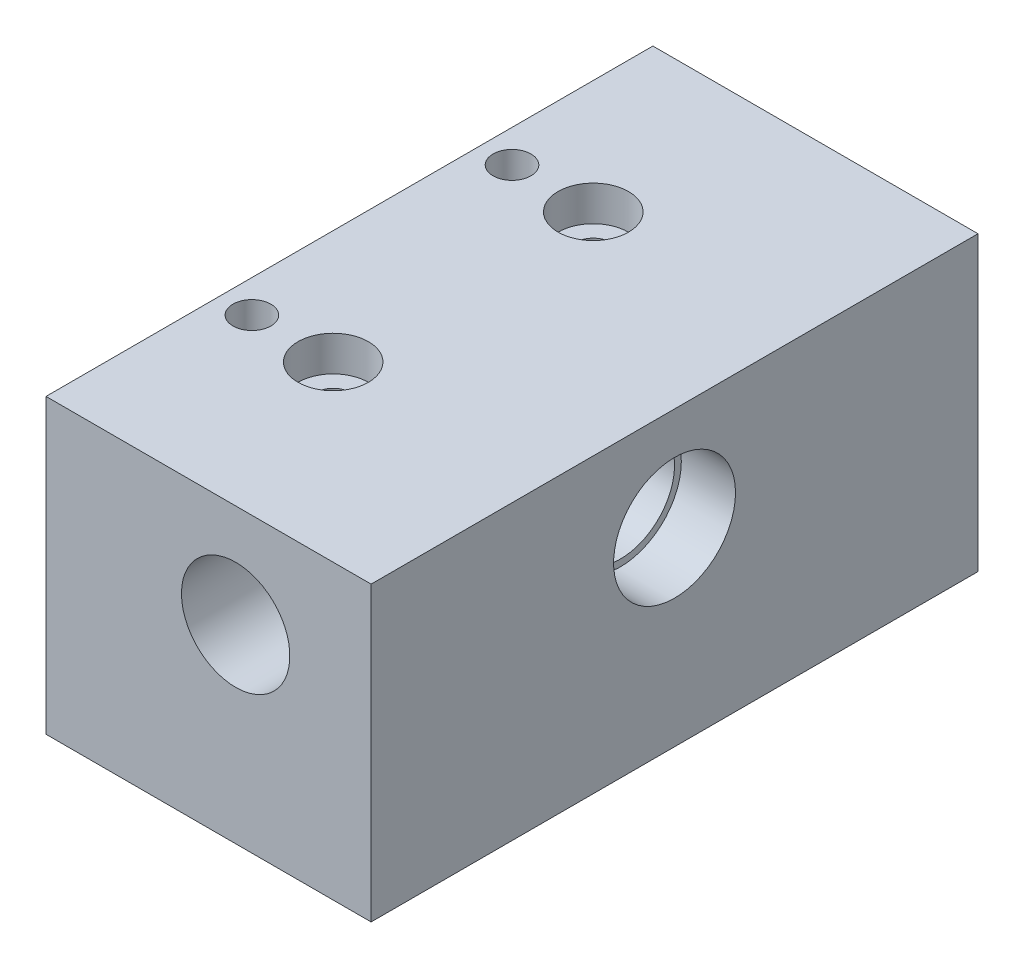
ISO-10303-21;
HEADER;
FILE_DESCRIPTION(('STEP AP214'),'2;1');
FILE_NAME('part.step','',(''),(''),'','','');
FILE_SCHEMA(('AUTOMOTIVE_DESIGN { 1 0 10303 214 1 1 1 1 }'));
ENDSEC;
DATA;
#1=APPLICATION_CONTEXT('core data for automotive mechanical design processes');
#2=APPLICATION_PROTOCOL_DEFINITION('international standard','automotive_design',2000,#1);
#3=PRODUCT_CONTEXT('',#1,'mechanical');
#4=PRODUCT('Part','Part','',(#3));
#5=PRODUCT_RELATED_PRODUCT_CATEGORY('part','',(#4));
#6=PRODUCT_DEFINITION_FORMATION('','',#4);
#7=PRODUCT_DEFINITION_CONTEXT('part definition',#1,'design');
#8=PRODUCT_DEFINITION('design','',#6,#7);
#9=PRODUCT_DEFINITION_SHAPE('','',#8);
#10=(LENGTH_UNIT() NAMED_UNIT(*) SI_UNIT(.MILLI.,.METRE.));
#11=(NAMED_UNIT(*) PLANE_ANGLE_UNIT() SI_UNIT($,.RADIAN.));
#12=(NAMED_UNIT(*) SI_UNIT($,.STERADIAN.) SOLID_ANGLE_UNIT());
#13=UNCERTAINTY_MEASURE_WITH_UNIT(LENGTH_MEASURE(1.E-05),#10,'distance_accuracy_value','');
#14=(GEOMETRIC_REPRESENTATION_CONTEXT(3) GLOBAL_UNCERTAINTY_ASSIGNED_CONTEXT((#13)) GLOBAL_UNIT_ASSIGNED_CONTEXT((#10,
#11,#12)) REPRESENTATION_CONTEXT('',''));
#15=CARTESIAN_POINT('',(0.,0.,0.));
#16=DIRECTION('',(0.,0.,1.));
#17=DIRECTION('',(1.,0.,0.));
#18=AXIS2_PLACEMENT_3D('',#15,#16,#17);
#19=CARTESIAN_POINT('',(120.,70.,0.));
#20=DIRECTION('',(-1.,0.,0.));
#21=DIRECTION('',(0.,0.,1.));
#22=AXIS2_PLACEMENT_3D('',#19,#20,#21);
#23=CYLINDRICAL_SURFACE('',#22,20.);
#24=CARTESIAN_POINT('',(70.,70.,0.));
#25=DIRECTION('',(0.707106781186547,0.,-0.707106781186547));
#26=DIRECTION('',(-0.707106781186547,0.,-0.707106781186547));
#27=AXIS2_PLACEMENT_3D('',#24,#25,#26);
#28=ELLIPSE('',#27,28.2842712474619,20.);
#29=CARTESIAN_POINT('',(70.,90.,0.));
#30=VERTEX_POINT('',#29);
#31=CARTESIAN_POINT('',(70.,50.,0.));
#32=VERTEX_POINT('',#31);
#33=EDGE_CURVE('E76',#30,#32,#28,.T.);
#34=ORIENTED_EDGE('',*,*,#33,.F.);
#35=CARTESIAN_POINT('',(70.,70.,0.));
#36=DIRECTION('',(-0.707106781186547,0.,-0.707106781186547));
#37=DIRECTION('',(0.707106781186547,0.,-0.707106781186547));
#38=AXIS2_PLACEMENT_3D('',#35,#36,#37);
#39=ELLIPSE('',#38,28.2842712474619,20.);
#40=EDGE_CURVE('E11',#32,#30,#39,.F.);
#41=ORIENTED_EDGE('',*,*,#40,.F.);
#42=EDGE_LOOP('',(#34,#41));
#43=FACE_BOUND('',#42,.T.);
#44=CARTESIAN_POINT('',(100.,70.,0.));
#45=DIRECTION('',(1.,0.,0.));
#46=DIRECTION('',(0.,0.,-1.));
#47=AXIS2_PLACEMENT_3D('',#44,#45,#46);
#48=CIRCLE('',#47,20.);
#49=CARTESIAN_POINT('',(100.,70.,-20.));
#50=VERTEX_POINT('',#49);
#51=EDGE_CURVE('E31',#50,#50,#48,.F.);
#52=ORIENTED_EDGE('',*,*,#51,.F.);
#53=EDGE_LOOP('',(#52));
#54=FACE_BOUND('',#53,.T.);
#55=ADVANCED_FACE('F27',(#43,#54),#23,.F.);
#56=CARTESIAN_POINT('',(70.,70.,112.));
#57=DIRECTION('',(0.,0.,-1.));
#58=DIRECTION('',(-1.,0.,0.));
#59=AXIS2_PLACEMENT_3D('',#56,#57,#58);
#60=CYLINDRICAL_SURFACE('',#59,20.);
#61=CARTESIAN_POINT('',(50.0183959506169,69.1423859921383,-77.3066556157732));
#62=CARTESIAN_POINT('',(50.0132434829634,69.2624535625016,-77.2594260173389));
#63=CARTESIAN_POINT('',(50.0090160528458,69.3863939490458,-77.2218296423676));
#64=CARTESIAN_POINT('',(50.0028618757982,69.6388788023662,-77.1675682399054));
#65=CARTESIAN_POINT('',(50.0009356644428,69.7674243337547,-77.1509080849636));
#66=CARTESIAN_POINT('',(49.9995883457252,70.027818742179,-77.1392233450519));
#67=CARTESIAN_POINT('',(50.0002124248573,70.1596856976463,-77.1445890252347));
#68=CARTESIAN_POINT('',(50.0039962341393,70.4205513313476,-77.1775761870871));
#69=CARTESIAN_POINT('',(50.007156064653,70.5495498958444,-77.2051985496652));
#70=CARTESIAN_POINT('',(50.015600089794,70.7995151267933,-77.2809002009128));
#71=CARTESIAN_POINT('',(50.020857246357,70.9205620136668,-77.3287195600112));
#72=CARTESIAN_POINT('',(50.0329516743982,71.1535204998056,-77.4427815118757));
#73=CARTESIAN_POINT('',(50.0397892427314,71.2654303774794,-77.5090275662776));
#74=CARTESIAN_POINT('',(50.0548460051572,71.4844621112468,-77.6621617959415));
#75=CARTESIAN_POINT('',(50.0631243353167,71.59086528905,-77.7500695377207));
#76=CARTESIAN_POINT('',(50.079927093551,71.7890238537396,-77.9410361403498));
#77=CARTESIAN_POINT('',(50.0884516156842,71.8807735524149,-78.0441008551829));
#78=CARTESIAN_POINT('',(50.1058074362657,72.0566190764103,-78.2733487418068));
#79=CARTESIAN_POINT('',(50.1145852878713,72.139052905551,-78.4008110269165));
#80=CARTESIAN_POINT('',(50.1306467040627,72.2834374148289,-78.6669301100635));
#81=CARTESIAN_POINT('',(50.1379296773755,72.3453799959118,-78.8055913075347));
#82=CARTESIAN_POINT('',(50.150864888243,72.4525558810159,-79.1033815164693));
#83=CARTESIAN_POINT('',(50.1563141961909,72.4958104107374,-79.2632336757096));
#84=CARTESIAN_POINT('',(50.1640363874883,72.5564586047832,-79.5878509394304));
#85=CARTESIAN_POINT('',(50.166308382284,72.5738450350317,-79.7526174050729));
#86=CARTESIAN_POINT('',(50.1674605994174,72.5827156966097,-80.0909921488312));
#87=CARTESIAN_POINT('',(50.1661686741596,72.5728851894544,-80.2646370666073));
#88=CARTESIAN_POINT('',(50.1599669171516,72.5246125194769,-80.6078705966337));
#89=CARTESIAN_POINT('',(50.1550565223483,72.4861659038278,-80.7774585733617));
#90=CARTESIAN_POINT('',(50.1421633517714,72.380994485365,-81.1084301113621));
#91=CARTESIAN_POINT('',(50.1341661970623,72.3141371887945,-81.2697712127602));
#92=CARTESIAN_POINT('',(50.1160803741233,72.1532000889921,-81.5782037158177));
#93=CARTESIAN_POINT('',(50.1059918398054,72.0591220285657,-81.7252960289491));
#94=CARTESIAN_POINT('',(50.0854942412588,71.8501289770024,-81.9937963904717));
#95=CARTESIAN_POINT('',(50.075117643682,71.7362846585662,-82.1160372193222));
#96=CARTESIAN_POINT('',(50.0550248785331,71.4877601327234,-82.3372228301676));
#97=CARTESIAN_POINT('',(50.0453082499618,71.3530946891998,-82.4361839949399));
#98=CARTESIAN_POINT('',(50.0287700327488,71.0802074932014,-82.5976952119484));
#99=CARTESIAN_POINT('',(50.0217622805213,70.9435068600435,-82.6627915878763));
#100=CARTESIAN_POINT('',(50.010400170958,70.6602268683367,-82.7661710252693));
#101=CARTESIAN_POINT('',(50.0060435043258,70.5136562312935,-82.8044774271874));
#102=CARTESIAN_POINT('',(50.0008906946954,70.2312715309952,-82.8495517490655));
#103=CARTESIAN_POINT('',(49.9997727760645,70.0959137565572,-82.8591729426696));
#104=CARTESIAN_POINT('',(50.0003041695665,69.8256282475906,-82.8545707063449));
#105=CARTESIAN_POINT('',(50.0019527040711,69.6907004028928,-82.8403539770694));
#106=CARTESIAN_POINT('',(50.0076862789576,69.431201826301,-82.789955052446));
#107=CARTESIAN_POINT('',(50.0116624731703,69.30643573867,-82.754752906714));
#108=CARTESIAN_POINT('',(50.0215337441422,69.0642713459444,-82.664797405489));
#109=CARTESIAN_POINT('',(50.0274290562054,68.9468739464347,-82.610041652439));
#110=CARTESIAN_POINT('',(50.0408196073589,68.7174768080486,-82.4805394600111));
#111=CARTESIAN_POINT('',(50.0483699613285,68.6058880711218,-82.4050733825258));
#112=CARTESIAN_POINT('',(50.0641745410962,68.3956299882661,-82.2379853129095));
#113=CARTESIAN_POINT('',(50.0724290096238,68.2969651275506,-82.1463577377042));
#114=CARTESIAN_POINT('',(50.0896676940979,68.1056001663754,-81.9405332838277));
#115=CARTESIAN_POINT('',(50.0986484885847,68.0143049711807,-81.8250306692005));
#116=CARTESIAN_POINT('',(50.1156877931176,67.8503640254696,-81.581423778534));
#117=CARTESIAN_POINT('',(50.1237459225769,67.7777259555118,-81.4533143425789));
#118=CARTESIAN_POINT('',(50.1388985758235,67.6459633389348,-81.174885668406));
#119=CARTESIAN_POINT('',(50.1458247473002,67.5888228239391,-81.0236164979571));
#120=CARTESIAN_POINT('',(50.1569511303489,67.4989071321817,-80.7139055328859));
#121=CARTESIAN_POINT('',(50.1611504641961,67.4661398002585,-80.5554614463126));
#122=CARTESIAN_POINT('',(50.1665576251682,67.4241381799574,-80.2252637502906));
#123=CARTESIAN_POINT('',(50.1675605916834,67.4165143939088,-80.0532999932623));
#124=CARTESIAN_POINT('',(50.1658827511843,67.4294306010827,-79.7104347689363));
#125=CARTESIAN_POINT('',(50.1632013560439,67.4499750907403,-79.5395334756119));
#126=CARTESIAN_POINT('',(50.1543790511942,67.5195601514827,-79.2004432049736));
#127=CARTESIAN_POINT('',(50.1481760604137,67.5691125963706,-79.0323602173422));
#128=CARTESIAN_POINT('',(50.1330082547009,67.6963673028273,-78.7072275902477));
#129=CARTESIAN_POINT('',(50.1240426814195,67.7740772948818,-78.5501809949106));
#130=CARTESIAN_POINT('',(50.104744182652,67.9538491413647,-78.2565170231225));
#131=CARTESIAN_POINT('',(50.0944541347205,68.055205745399,-78.119466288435));
#132=CARTESIAN_POINT('',(50.0736667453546,68.2812705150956,-77.866361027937));
#133=CARTESIAN_POINT('',(50.0631697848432,68.4059388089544,-77.750271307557));
#134=CARTESIAN_POINT('',(50.0465912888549,68.6325288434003,-77.5772257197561));
#135=CARTESIAN_POINT('',(50.0401666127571,68.7290902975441,-77.5132012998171));
#136=CARTESIAN_POINT('',(50.0283789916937,68.9301940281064,-77.3990918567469));
#137=CARTESIAN_POINT('',(50.0230156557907,69.0347333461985,-77.349001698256));
#138=CARTESIAN_POINT('',(50.0183959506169,69.1423859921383,-77.3066556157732));
#139=B_SPLINE_CURVE_WITH_KNOTS('',3,(#61,#62,#63,#64,#65,#66,#67,#68,#69,#70,#71,#72,#73,#74,
#75,#76,#77,#78,#79,#80,#81,#82,#83,#84,#85,#86,#87,#88,#89,#90,#91,#92,#93,#94,#95,#96,#97,#98,
#99,#100,#101,#102,#103,#104,#105,#106,#107,#108,#109,#110,#111,#112,#113,#114,#115,#116,#117,
#118,#119,#120,#121,#122,#123,#124,#125,#126,#127,#128,#129,#130,#131,#132,#133,#134,#135,#136,
#137,#138),.UNSPECIFIED.,.T.,.F.,(4,2,2,2,2,2,2,2,2,2,2,2,2,2,2,2,2,2,2,2,2,2,2,2,2,2,2,2,2,2,2,
2,2,2,2,2,2,2,4),(0.,0.386992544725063,0.774075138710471,1.16804559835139,1.56203165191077,
1.95109470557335,2.34023089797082,2.75331875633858,3.16656658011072,3.62080628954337,
4.0752253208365,4.57010405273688,5.06512115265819,5.58446197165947,6.1038836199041,
6.62575465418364,7.14759228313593,7.64697764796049,8.14601051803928,8.59818751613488,
9.04997006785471,9.45500482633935,9.85992575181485,10.2472736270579,10.6346690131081,
11.0377496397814,11.4409697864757,11.8816368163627,12.32248496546,12.8059318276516,
13.2895342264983,13.8035662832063,14.3176804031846,14.8411523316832,15.364768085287,
15.8744096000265,16.3831872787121,16.7302930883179,17.077270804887),.UNSPECIFIED.);
#140=CARTESIAN_POINT('',(50.0183959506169,69.1423859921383,-77.3066556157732));
#141=VERTEX_POINT('',#140);
#142=EDGE_CURVE('E187',#141,#141,#139,.T.);
#143=ORIENTED_EDGE('',*,*,#142,.T.);
#144=EDGE_LOOP('',(#143));
#145=FACE_BOUND('',#144,.T.);
#146=CARTESIAN_POINT('',(70.,70.,-112.));
#147=DIRECTION('',(0.,0.,-1.));
#148=DIRECTION('',(-1.,0.,0.));
#149=AXIS2_PLACEMENT_3D('',#146,#147,#148);
#150=CIRCLE('',#149,20.);
#151=CARTESIAN_POINT('',(50.,70.,-112.));
#152=VERTEX_POINT('',#151);
#153=EDGE_CURVE('E184',#152,#152,#150,.T.);
#154=ORIENTED_EDGE('',*,*,#153,.T.);
#155=EDGE_LOOP('',(#154));
#156=FACE_BOUND('',#155,.T.);
#157=CARTESIAN_POINT('',(70.,70.,0.));
#158=DIRECTION('',(0.707106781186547,0.,-0.707106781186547));
#159=DIRECTION('',(-0.707106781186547,0.,-0.707106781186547));
#160=AXIS2_PLACEMENT_3D('',#157,#158,#159);
#161=ELLIPSE('',#160,28.2842712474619,20.);
#162=EDGE_CURVE('E41',#30,#32,#161,.F.);
#163=ORIENTED_EDGE('',*,*,#162,.T.);
#164=ORIENTED_EDGE('',*,*,#40,.T.);
#165=EDGE_LOOP('',(#163,#164));
#166=FACE_BOUND('',#165,.T.);
#167=ADVANCED_FACE('F85',(#145,#156,#166),#60,.F.);
#168=CARTESIAN_POINT('',(0.,108.,112.));
#169=DIRECTION('',(0.,-1.,0.));
#170=DIRECTION('',(0.,0.,-1.));
#171=AXIS2_PLACEMENT_3D('',#168,#169,#170);
#172=PLANE('',#171);
#173=CARTESIAN_POINT('',(12.,108.,48.));
#174=DIRECTION('',(0.,1.,0.));
#175=DIRECTION('',(0.,0.,1.));
#176=AXIS2_PLACEMENT_3D('',#173,#174,#175);
#177=CIRCLE('',#176,7.);
#178=CARTESIAN_POINT('',(12.,108.,55.));
#179=VERTEX_POINT('',#178);
#180=EDGE_CURVE('E268',#179,#179,#177,.T.);
#181=ORIENTED_EDGE('',*,*,#180,.F.);
#182=EDGE_LOOP('',(#181));
#183=FACE_BOUND('',#182,.T.);
#184=DIRECTION('',(0.,0.,-1.));
#185=VECTOR('',#184,1.);
#186=CARTESIAN_POINT('',(120.,108.,112.));
#187=LINE('',#186,#185);
#188=CARTESIAN_POINT('',(120.,108.,112.));
#189=VERTEX_POINT('',#188);
#190=CARTESIAN_POINT('',(120.,108.,-112.));
#191=VERTEX_POINT('',#190);
#192=EDGE_CURVE('E292',#189,#191,#187,.T.);
#193=ORIENTED_EDGE('',*,*,#192,.T.);
#194=DIRECTION('',(-1.,0.,0.));
#195=VECTOR('',#194,1.);
#196=CARTESIAN_POINT('',(0.,108.,-112.));
#197=LINE('',#196,#195);
#198=CARTESIAN_POINT('',(0.,108.,-112.));
#199=VERTEX_POINT('',#198);
#200=EDGE_CURVE('E206',#191,#199,#197,.T.);
#201=ORIENTED_EDGE('',*,*,#200,.T.);
#202=DIRECTION('',(0.,0.,-1.));
#203=VECTOR('',#202,1.);
#204=CARTESIAN_POINT('',(0.,108.,112.));
#205=LINE('',#204,#203);
#206=CARTESIAN_POINT('',(0.,108.,112.));
#207=VERTEX_POINT('',#206);
#208=EDGE_CURVE('E290',#207,#199,#205,.T.);
#209=ORIENTED_EDGE('',*,*,#208,.F.);
#210=DIRECTION('',(-1.,0.,0.));
#211=VECTOR('',#210,1.);
#212=CARTESIAN_POINT('',(0.,108.,112.));
#213=LINE('',#212,#211);
#214=EDGE_CURVE('E49',#189,#207,#213,.T.);
#215=ORIENTED_EDGE('',*,*,#214,.F.);
#216=EDGE_LOOP('',(#193,#201,#209,#215));
#217=FACE_BOUND('',#216,.T.);
#218=CARTESIAN_POINT('',(42.,108.,48.));
#219=DIRECTION('',(0.,1.,0.));
#220=DIRECTION('',(0.,0.,1.));
#221=AXIS2_PLACEMENT_3D('',#218,#219,#220);
#222=CIRCLE('',#221,13.);
#223=CARTESIAN_POINT('',(42.,108.,61.));
#224=VERTEX_POINT('',#223);
#225=EDGE_CURVE('E263',#224,#224,#222,.T.);
#226=ORIENTED_EDGE('',*,*,#225,.F.);
#227=EDGE_LOOP('',(#226));
#228=FACE_BOUND('',#227,.T.);
#229=CARTESIAN_POINT('',(12.,108.,-48.));
#230=DIRECTION('',(0.,-1.,0.));
#231=DIRECTION('',(0.,0.,-1.));
#232=AXIS2_PLACEMENT_3D('',#229,#230,#231);
#233=CIRCLE('',#232,7.);
#234=CARTESIAN_POINT('',(12.,108.,-55.));
#235=VERTEX_POINT('',#234);
#236=EDGE_CURVE('E169',#235,#235,#233,.T.);
#237=ORIENTED_EDGE('',*,*,#236,.T.);
#238=EDGE_LOOP('',(#237));
#239=FACE_BOUND('',#238,.T.);
#240=CARTESIAN_POINT('',(42.,108.,-48.));
#241=DIRECTION('',(0.,-1.,0.));
#242=DIRECTION('',(0.,0.,-1.));
#243=AXIS2_PLACEMENT_3D('',#240,#241,#242);
#244=CIRCLE('',#243,13.);
#245=CARTESIAN_POINT('',(42.,108.,-61.));
#246=VERTEX_POINT('',#245);
#247=EDGE_CURVE('E172',#246,#246,#244,.T.);
#248=ORIENTED_EDGE('',*,*,#247,.T.);
#249=EDGE_LOOP('',(#248));
#250=FACE_BOUND('',#249,.T.);
#251=ADVANCED_FACE('F134',(#183,#217,#228,#239,#250),#172,.F.);
#252=CARTESIAN_POINT('',(0.,0.,112.));
#253=DIRECTION('',(1.,0.,0.));
#254=DIRECTION('',(0.,0.,-1.));
#255=AXIS2_PLACEMENT_3D('',#252,#253,#254);
#256=PLANE('',#255);
#257=CARTESIAN_POINT('',(0.,70.,0.));
#258=DIRECTION('',(-1.,0.,0.));
#259=DIRECTION('',(0.,0.,1.));
#260=AXIS2_PLACEMENT_3D('',#257,#258,#259);
#261=CIRCLE('',#260,20.);
#262=CARTESIAN_POINT('',(0.,70.,20.));
#263=VERTEX_POINT('',#262);
#264=EDGE_CURVE('E152',#263,#263,#261,.T.);
#265=ORIENTED_EDGE('',*,*,#264,.F.);
#266=EDGE_LOOP('',(#265));
#267=FACE_BOUND('',#266,.T.);
#268=CARTESIAN_POINT('',(0.,70.,80.));
#269=DIRECTION('',(-1.,0.,0.));
#270=DIRECTION('',(0.,0.,1.));
#271=AXIS2_PLACEMENT_3D('',#268,#269,#270);
#272=CIRCLE('',#271,20.);
#273=CARTESIAN_POINT('',(0.,70.,100.));
#274=VERTEX_POINT('',#273);
#275=EDGE_CURVE('E97',#274,#274,#272,.T.);
#276=ORIENTED_EDGE('',*,*,#275,.F.);
#277=EDGE_LOOP('',(#276));
#278=FACE_BOUND('',#277,.T.);
#279=ORIENTED_EDGE('',*,*,#208,.T.);
#280=DIRECTION('',(0.,-1.,0.));
#281=VECTOR('',#280,1.);
#282=CARTESIAN_POINT('',(0.,0.,-112.));
#283=LINE('',#282,#281);
#284=CARTESIAN_POINT('',(0.,0.,-112.));
#285=VERTEX_POINT('',#284);
#286=EDGE_CURVE('E197',#199,#285,#283,.T.);
#287=ORIENTED_EDGE('',*,*,#286,.T.);
#288=DIRECTION('',(0.,0.,-1.));
#289=VECTOR('',#288,1.);
#290=CARTESIAN_POINT('',(0.,0.,112.));
#291=LINE('',#290,#289);
#292=CARTESIAN_POINT('',(0.,0.,112.));
#293=VERTEX_POINT('',#292);
#294=EDGE_CURVE('E83',#293,#285,#291,.T.);
#295=ORIENTED_EDGE('',*,*,#294,.F.);
#296=DIRECTION('',(0.,-1.,0.));
#297=VECTOR('',#296,1.);
#298=CARTESIAN_POINT('',(0.,0.,112.));
#299=LINE('',#298,#297);
#300=EDGE_CURVE('E283',#207,#293,#299,.T.);
#301=ORIENTED_EDGE('',*,*,#300,.F.);
#302=EDGE_LOOP('',(#279,#287,#295,#301));
#303=FACE_BOUND('',#302,.T.);
#304=CARTESIAN_POINT('',(0.,70.,-80.));
#305=DIRECTION('',(1.,0.,0.));
#306=DIRECTION('',(0.,0.,-1.));
#307=AXIS2_PLACEMENT_3D('',#304,#305,#306);
#308=CIRCLE('',#307,20.);
#309=CARTESIAN_POINT('',(0.,70.,-100.));
#310=VERTEX_POINT('',#309);
#311=EDGE_CURVE('E188',#310,#310,#308,.T.);
#312=ORIENTED_EDGE('',*,*,#311,.T.);
#313=EDGE_LOOP('',(#312));
#314=FACE_BOUND('',#313,.T.);
#315=ADVANCED_FACE('F29',(#267,#278,#303,#314),#256,.F.);
#316=CARTESIAN_POINT('',(0.,0.,112.));
#317=DIRECTION('',(0.,1.,0.));
#318=DIRECTION('',(0.,0.,1.));
#319=AXIS2_PLACEMENT_3D('',#316,#317,#318);
#320=PLANE('',#319);
#321=CARTESIAN_POINT('',(12.,0.,48.));
#322=DIRECTION('',(0.,-1.,0.));
#323=DIRECTION('',(0.,0.,-1.));
#324=AXIS2_PLACEMENT_3D('',#321,#322,#323);
#325=CIRCLE('',#324,5.99999999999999);
#326=CARTESIAN_POINT('',(12.,0.,42.));
#327=VERTEX_POINT('',#326);
#328=EDGE_CURVE('E209',#327,#327,#325,.T.);
#329=ORIENTED_EDGE('',*,*,#328,.F.);
#330=EDGE_LOOP('',(#329));
#331=FACE_BOUND('',#330,.T.);
#332=CARTESIAN_POINT('',(42.,0.,48.));
#333=DIRECTION('',(0.,1.,0.));
#334=DIRECTION('',(0.,0.,1.));
#335=AXIS2_PLACEMENT_3D('',#332,#333,#334);
#336=CIRCLE('',#335,6.49999999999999);
#337=CARTESIAN_POINT('',(42.,0.,54.5));
#338=VERTEX_POINT('',#337);
#339=EDGE_CURVE('E265',#338,#338,#336,.T.);
#340=ORIENTED_EDGE('',*,*,#339,.T.);
#341=EDGE_LOOP('',(#340));
#342=FACE_BOUND('',#341,.T.);
#343=ORIENTED_EDGE('',*,*,#294,.T.);
#344=DIRECTION('',(1.,0.,0.));
#345=VECTOR('',#344,1.);
#346=CARTESIAN_POINT('',(0.,0.,-112.));
#347=LINE('',#346,#345);
#348=CARTESIAN_POINT('',(120.,0.,-112.));
#349=VERTEX_POINT('',#348);
#350=EDGE_CURVE('E200',#285,#349,#347,.T.);
#351=ORIENTED_EDGE('',*,*,#350,.T.);
#352=DIRECTION('',(0.,0.,-1.));
#353=VECTOR('',#352,1.);
#354=CARTESIAN_POINT('',(120.,0.,112.));
#355=LINE('',#354,#353);
#356=CARTESIAN_POINT('',(120.,0.,112.));
#357=VERTEX_POINT('',#356);
#358=EDGE_CURVE('E293',#357,#349,#355,.T.);
#359=ORIENTED_EDGE('',*,*,#358,.F.);
#360=DIRECTION('',(1.,0.,0.));
#361=VECTOR('',#360,1.);
#362=CARTESIAN_POINT('',(0.,0.,112.));
#363=LINE('',#362,#361);
#364=EDGE_CURVE('E285',#293,#357,#363,.T.);
#365=ORIENTED_EDGE('',*,*,#364,.F.);
#366=EDGE_LOOP('',(#343,#351,#359,#365));
#367=FACE_BOUND('',#366,.T.);
#368=CARTESIAN_POINT('',(12.,0.,-48.));
#369=DIRECTION('',(0.,1.,0.));
#370=DIRECTION('',(0.,0.,1.));
#371=AXIS2_PLACEMENT_3D('',#368,#369,#370);
#372=CIRCLE('',#371,5.99999999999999);
#373=CARTESIAN_POINT('',(12.,0.,-42.));
#374=VERTEX_POINT('',#373);
#375=EDGE_CURVE('E154',#374,#374,#372,.T.);
#376=ORIENTED_EDGE('',*,*,#375,.T.);
#377=EDGE_LOOP('',(#376));
#378=FACE_BOUND('',#377,.T.);
#379=CARTESIAN_POINT('',(42.,0.,-48.));
#380=DIRECTION('',(0.,-1.,0.));
#381=DIRECTION('',(0.,0.,-1.));
#382=AXIS2_PLACEMENT_3D('',#379,#380,#381);
#383=CIRCLE('',#382,6.49999999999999);
#384=CARTESIAN_POINT('',(42.,0.,-54.5));
#385=VERTEX_POINT('',#384);
#386=EDGE_CURVE('E181',#385,#385,#383,.T.);
#387=ORIENTED_EDGE('',*,*,#386,.F.);
#388=EDGE_LOOP('',(#387));
#389=FACE_BOUND('',#388,.T.);
#390=ADVANCED_FACE('F301',(#331,#342,#367,#378,#389),#320,.F.);
#391=CARTESIAN_POINT('',(120.,0.,112.));
#392=DIRECTION('',(-1.,0.,0.));
#393=DIRECTION('',(0.,0.,1.));
#394=AXIS2_PLACEMENT_3D('',#391,#392,#393);
#395=PLANE('',#394);
#396=CARTESIAN_POINT('',(120.,70.,0.));
#397=DIRECTION('',(1.,0.,0.));
#398=DIRECTION('',(0.,0.,-1.));
#399=AXIS2_PLACEMENT_3D('',#396,#397,#398);
#400=CIRCLE('',#399,22.5);
#401=CARTESIAN_POINT('',(120.,70.,-22.5));
#402=VERTEX_POINT('',#401);
#403=EDGE_CURVE('E447',#402,#402,#400,.T.);
#404=ORIENTED_EDGE('',*,*,#403,.F.);
#405=EDGE_LOOP('',(#404));
#406=FACE_BOUND('',#405,.T.);
#407=ORIENTED_EDGE('',*,*,#358,.T.);
#408=DIRECTION('',(0.,1.,0.));
#409=VECTOR('',#408,1.);
#410=CARTESIAN_POINT('',(120.,0.,-112.));
#411=LINE('',#410,#409);
#412=EDGE_CURVE('E203',#349,#191,#411,.T.);
#413=ORIENTED_EDGE('',*,*,#412,.T.);
#414=ORIENTED_EDGE('',*,*,#192,.F.);
#415=DIRECTION('',(0.,1.,0.));
#416=VECTOR('',#415,1.);
#417=CARTESIAN_POINT('',(120.,0.,112.));
#418=LINE('',#417,#416);
#419=EDGE_CURVE('E287',#357,#189,#418,.T.);
#420=ORIENTED_EDGE('',*,*,#419,.F.);
#421=EDGE_LOOP('',(#407,#413,#414,#420));
#422=FACE_BOUND('',#421,.T.);
#423=ADVANCED_FACE('F123',(#406,#422),#395,.F.);
#424=CARTESIAN_POINT('',(0.,108.,112.));
#425=DIRECTION('',(0.,0.,-1.));
#426=DIRECTION('',(-1.,0.,0.));
#427=AXIS2_PLACEMENT_3D('',#424,#425,#426);
#428=PLANE('',#427);
#429=CARTESIAN_POINT('',(70.,70.,112.));
#430=DIRECTION('',(0.,0.,-1.));
#431=DIRECTION('',(-1.,0.,0.));
#432=AXIS2_PLACEMENT_3D('',#429,#430,#431);
#433=CIRCLE('',#432,20.);
#434=CARTESIAN_POINT('',(50.,70.,112.));
#435=VERTEX_POINT('',#434);
#436=EDGE_CURVE('E98',#435,#435,#433,.T.);
#437=ORIENTED_EDGE('',*,*,#436,.T.);
#438=EDGE_LOOP('',(#437));
#439=FACE_BOUND('',#438,.T.);
#440=ORIENTED_EDGE('',*,*,#300,.T.);
#441=ORIENTED_EDGE('',*,*,#364,.T.);
#442=ORIENTED_EDGE('',*,*,#419,.T.);
#443=ORIENTED_EDGE('',*,*,#214,.T.);
#444=EDGE_LOOP('',(#440,#441,#442,#443));
#445=FACE_BOUND('',#444,.T.);
#446=ADVANCED_FACE('F115',(#439,#445),#428,.F.);
#447=CARTESIAN_POINT('',(40.,70.,80.));
#448=DIRECTION('',(1.,0.,0.));
#449=DIRECTION('',(0.,0.,-1.));
#450=AXIS2_PLACEMENT_3D('',#447,#448,#449);
#451=PLANE('',#450);
#452=CARTESIAN_POINT('',(40.,70.,80.));
#453=DIRECTION('',(-1.,0.,0.));
#454=DIRECTION('',(0.,0.,1.));
#455=AXIS2_PLACEMENT_3D('',#452,#453,#454);
#456=CIRCLE('',#455,20.);
#457=CARTESIAN_POINT('',(40.,70.,100.));
#458=VERTEX_POINT('',#457);
#459=EDGE_CURVE('E278',#458,#458,#456,.T.);
#460=ORIENTED_EDGE('',*,*,#459,.T.);
#461=EDGE_LOOP('',(#460));
#462=FACE_BOUND('',#461,.T.);
#463=CARTESIAN_POINT('',(40.,70.,80.));
#464=DIRECTION('',(1.,0.,0.));
#465=DIRECTION('',(0.,0.,-1.));
#466=AXIS2_PLACEMENT_3D('',#463,#464,#465);
#467=CIRCLE('',#466,19.5);
#468=CARTESIAN_POINT('',(40.,70.,60.5));
#469=VERTEX_POINT('',#468);
#470=EDGE_CURVE('E280',#469,#469,#467,.F.);
#471=ORIENTED_EDGE('',*,*,#470,.F.);
#472=EDGE_LOOP('',(#471));
#473=FACE_BOUND('',#472,.T.);
#474=ADVANCED_FACE('F112',(#462,#473),#451,.F.);
#475=CARTESIAN_POINT('',(0.,70.,80.));
#476=DIRECTION('',(-1.,0.,0.));
#477=DIRECTION('',(0.,0.,1.));
#478=AXIS2_PLACEMENT_3D('',#475,#476,#477);
#479=CYLINDRICAL_SURFACE('',#478,20.);
#480=ORIENTED_EDGE('',*,*,#459,.F.);
#481=EDGE_LOOP('',(#480));
#482=FACE_BOUND('',#481,.T.);
#483=ORIENTED_EDGE('',*,*,#275,.T.);
#484=EDGE_LOOP('',(#483));
#485=FACE_BOUND('',#484,.T.);
#486=ADVANCED_FACE('F110',(#482,#485),#479,.F.);
#487=CARTESIAN_POINT('',(40.,70.,80.));
#488=DIRECTION('',(-1.,0.,0.));
#489=DIRECTION('',(0.,0.,1.));
#490=AXIS2_PLACEMENT_3D('',#487,#488,#489);
#491=CONICAL_SURFACE('',#490,19.5,1.02974425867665);
#492=CARTESIAN_POINT('',(50.0183959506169,69.1423859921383,77.3066556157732));
#493=CARTESIAN_POINT('',(50.0132434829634,69.2624535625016,77.2594260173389));
#494=CARTESIAN_POINT('',(50.0090160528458,69.3863939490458,77.2218296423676));
#495=CARTESIAN_POINT('',(50.0028618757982,69.6388788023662,77.1675682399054));
#496=CARTESIAN_POINT('',(50.0009356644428,69.7674243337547,77.1509080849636));
#497=CARTESIAN_POINT('',(49.9995883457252,70.027818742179,77.1392233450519));
#498=CARTESIAN_POINT('',(50.0002124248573,70.1596856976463,77.1445890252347));
#499=CARTESIAN_POINT('',(50.0039962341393,70.4205513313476,77.1775761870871));
#500=CARTESIAN_POINT('',(50.007156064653,70.5495498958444,77.2051985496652));
#501=CARTESIAN_POINT('',(50.015600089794,70.7995151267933,77.2809002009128));
#502=CARTESIAN_POINT('',(50.020857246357,70.9205620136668,77.3287195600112));
#503=CARTESIAN_POINT('',(50.0329516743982,71.1535204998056,77.4427815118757));
#504=CARTESIAN_POINT('',(50.0397892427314,71.2654303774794,77.5090275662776));
#505=CARTESIAN_POINT('',(50.0548460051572,71.4844621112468,77.6621617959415));
#506=CARTESIAN_POINT('',(50.0631243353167,71.59086528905,77.7500695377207));
#507=CARTESIAN_POINT('',(50.079927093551,71.7890238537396,77.9410361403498));
#508=CARTESIAN_POINT('',(50.0884516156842,71.8807735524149,78.0441008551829));
#509=CARTESIAN_POINT('',(50.1058074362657,72.0566190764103,78.2733487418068));
#510=CARTESIAN_POINT('',(50.1145852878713,72.139052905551,78.4008110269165));
#511=CARTESIAN_POINT('',(50.1306467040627,72.2834374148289,78.6669301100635));
#512=CARTESIAN_POINT('',(50.1379296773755,72.3453799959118,78.8055913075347));
#513=CARTESIAN_POINT('',(50.150864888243,72.4525558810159,79.1033815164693));
#514=CARTESIAN_POINT('',(50.1563141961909,72.4958104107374,79.2632336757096));
#515=CARTESIAN_POINT('',(50.1640363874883,72.5564586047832,79.5878509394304));
#516=CARTESIAN_POINT('',(50.166308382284,72.5738450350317,79.7526174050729));
#517=CARTESIAN_POINT('',(50.1674605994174,72.5827156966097,80.0909921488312));
#518=CARTESIAN_POINT('',(50.1661686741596,72.5728851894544,80.2646370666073));
#519=CARTESIAN_POINT('',(50.1599669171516,72.5246125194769,80.6078705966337));
#520=CARTESIAN_POINT('',(50.1550565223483,72.4861659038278,80.7774585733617));
#521=CARTESIAN_POINT('',(50.1421633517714,72.380994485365,81.1084301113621));
#522=CARTESIAN_POINT('',(50.1341661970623,72.3141371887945,81.2697712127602));
#523=CARTESIAN_POINT('',(50.1160803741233,72.1532000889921,81.5782037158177));
#524=CARTESIAN_POINT('',(50.1059918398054,72.0591220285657,81.7252960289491));
#525=CARTESIAN_POINT('',(50.0854942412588,71.8501289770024,81.9937963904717));
#526=CARTESIAN_POINT('',(50.075117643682,71.7362846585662,82.1160372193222));
#527=CARTESIAN_POINT('',(50.0550248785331,71.4877601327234,82.3372228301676));
#528=CARTESIAN_POINT('',(50.0453082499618,71.3530946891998,82.4361839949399));
#529=CARTESIAN_POINT('',(50.0287700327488,71.0802074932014,82.5976952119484));
#530=CARTESIAN_POINT('',(50.0217622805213,70.9435068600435,82.6627915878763));
#531=CARTESIAN_POINT('',(50.010400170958,70.6602268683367,82.7661710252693));
#532=CARTESIAN_POINT('',(50.0060435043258,70.5136562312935,82.8044774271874));
#533=CARTESIAN_POINT('',(50.0008906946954,70.2312715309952,82.8495517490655));
#534=CARTESIAN_POINT('',(49.9997727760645,70.0959137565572,82.8591729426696));
#535=CARTESIAN_POINT('',(50.0003041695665,69.8256282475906,82.8545707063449));
#536=CARTESIAN_POINT('',(50.0019527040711,69.6907004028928,82.8403539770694));
#537=CARTESIAN_POINT('',(50.0076862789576,69.431201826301,82.789955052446));
#538=CARTESIAN_POINT('',(50.0116624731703,69.30643573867,82.754752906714));
#539=CARTESIAN_POINT('',(50.0215337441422,69.0642713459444,82.664797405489));
#540=CARTESIAN_POINT('',(50.0274290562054,68.9468739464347,82.610041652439));
#541=CARTESIAN_POINT('',(50.0408196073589,68.7174768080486,82.4805394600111));
#542=CARTESIAN_POINT('',(50.0483699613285,68.6058880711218,82.4050733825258));
#543=CARTESIAN_POINT('',(50.0641745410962,68.3956299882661,82.2379853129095));
#544=CARTESIAN_POINT('',(50.0724290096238,68.2969651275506,82.1463577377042));
#545=CARTESIAN_POINT('',(50.0896676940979,68.1056001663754,81.9405332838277));
#546=CARTESIAN_POINT('',(50.0986484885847,68.0143049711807,81.8250306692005));
#547=CARTESIAN_POINT('',(50.1156877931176,67.8503640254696,81.581423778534));
#548=CARTESIAN_POINT('',(50.1237459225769,67.7777259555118,81.4533143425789));
#549=CARTESIAN_POINT('',(50.1388985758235,67.6459633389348,81.174885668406));
#550=CARTESIAN_POINT('',(50.1458247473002,67.5888228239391,81.0236164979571));
#551=CARTESIAN_POINT('',(50.1569511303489,67.4989071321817,80.7139055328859));
#552=CARTESIAN_POINT('',(50.1611504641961,67.4661398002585,80.5554614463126));
#553=CARTESIAN_POINT('',(50.1665576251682,67.4241381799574,80.2252637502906));
#554=CARTESIAN_POINT('',(50.1675605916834,67.4165143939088,80.0532999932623));
#555=CARTESIAN_POINT('',(50.1658827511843,67.4294306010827,79.7104347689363));
#556=CARTESIAN_POINT('',(50.1632013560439,67.4499750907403,79.5395334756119));
#557=CARTESIAN_POINT('',(50.1543790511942,67.5195601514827,79.2004432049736));
#558=CARTESIAN_POINT('',(50.1481760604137,67.5691125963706,79.0323602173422));
#559=CARTESIAN_POINT('',(50.1330082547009,67.6963673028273,78.7072275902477));
#560=CARTESIAN_POINT('',(50.1240426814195,67.7740772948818,78.5501809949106));
#561=CARTESIAN_POINT('',(50.104744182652,67.9538491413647,78.2565170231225));
#562=CARTESIAN_POINT('',(50.0944541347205,68.055205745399,78.119466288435));
#563=CARTESIAN_POINT('',(50.0736667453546,68.2812705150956,77.866361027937));
#564=CARTESIAN_POINT('',(50.0631697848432,68.4059388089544,77.750271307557));
#565=CARTESIAN_POINT('',(50.0465912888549,68.6325288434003,77.5772257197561));
#566=CARTESIAN_POINT('',(50.0401666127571,68.7290902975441,77.5132012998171));
#567=CARTESIAN_POINT('',(50.0283789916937,68.9301940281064,77.3990918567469));
#568=CARTESIAN_POINT('',(50.0230156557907,69.0347333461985,77.349001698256));
#569=CARTESIAN_POINT('',(50.0183959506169,69.1423859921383,77.3066556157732));
#570=B_SPLINE_CURVE_WITH_KNOTS('',3,(#492,#493,#494,#495,#496,#497,#498,#499,#500,#501,#502,
#503,#504,#505,#506,#507,#508,#509,#510,#511,#512,#513,#514,#515,#516,#517,#518,#519,#520,#521,
#522,#523,#524,#525,#526,#527,#528,#529,#530,#531,#532,#533,#534,#535,#536,#537,#538,#539,#540,
#541,#542,#543,#544,#545,#546,#547,#548,#549,#550,#551,#552,#553,#554,#555,#556,#557,#558,#559,
#560,#561,#562,#563,#564,#565,#566,#567,#568,#569),.UNSPECIFIED.,.T.,.F.,(4,2,2,2,2,2,2,2,2,2,2,
2,2,2,2,2,2,2,2,2,2,2,2,2,2,2,2,2,2,2,2,2,2,2,2,2,2,2,4),(0.,0.386992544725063,
0.774075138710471,1.16804559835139,1.56203165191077,1.95109470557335,2.34023089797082,
2.75331875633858,3.16656658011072,3.62080628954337,4.0752253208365,4.57010405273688,
5.06512115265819,5.58446197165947,6.1038836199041,6.62575465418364,7.14759228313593,
7.64697764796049,8.14601051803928,8.59818751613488,9.04997006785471,9.45500482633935,
9.85992575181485,10.2472736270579,10.6346690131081,11.0377496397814,11.4409697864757,
11.8816368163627,12.32248496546,12.8059318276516,13.2895342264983,13.8035662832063,
14.3176804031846,14.8411523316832,15.364768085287,15.8744096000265,16.3831872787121,
16.7302930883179,17.077270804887),.UNSPECIFIED.);
#571=CARTESIAN_POINT('',(50.0183959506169,69.1423859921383,77.3066556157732));
#572=VERTEX_POINT('',#571);
#573=EDGE_CURVE('E90',#572,#572,#570,.T.);
#574=ORIENTED_EDGE('',*,*,#573,.T.);
#575=EDGE_LOOP('',(#574));
#576=FACE_BOUND('',#575,.T.);
#577=ORIENTED_EDGE('',*,*,#470,.T.);
#578=EDGE_LOOP('',(#577));
#579=FACE_BOUND('',#578,.T.);
#580=ADVANCED_FACE('F100',(#576,#579),#491,.F.);
#581=ORIENTED_EDGE('',*,*,#33,.T.);
#582=CARTESIAN_POINT('',(70.,70.,0.));
#583=DIRECTION('',(-0.707106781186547,0.,-0.707106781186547));
#584=DIRECTION('',(0.707106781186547,0.,-0.707106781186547));
#585=AXIS2_PLACEMENT_3D('',#582,#583,#584);
#586=ELLIPSE('',#585,28.2842712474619,20.);
#587=EDGE_CURVE('E36',#32,#30,#586,.T.);
#588=ORIENTED_EDGE('',*,*,#587,.T.);
#589=EDGE_LOOP('',(#581,#588));
#590=FACE_BOUND('',#589,.T.);
#591=ORIENTED_EDGE('',*,*,#436,.F.);
#592=EDGE_LOOP('',(#591));
#593=FACE_BOUND('',#592,.T.);
#594=ORIENTED_EDGE('',*,*,#573,.F.);
#595=EDGE_LOOP('',(#594));
#596=FACE_BOUND('',#595,.T.);
#597=ADVANCED_FACE('F86',(#590,#593,#596),#60,.F.);
#598=CARTESIAN_POINT('',(42.,108.,48.));
#599=DIRECTION('',(0.,1.,0.));
#600=DIRECTION('',(0.,0.,1.));
#601=AXIS2_PLACEMENT_3D('',#598,#599,#600);
#602=CYLINDRICAL_SURFACE('',#601,6.49999999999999);
#603=ORIENTED_EDGE('',*,*,#339,.F.);
#604=EDGE_LOOP('',(#603));
#605=FACE_BOUND('',#604,.T.);
#606=CARTESIAN_POINT('',(42.,95.,48.));
#607=DIRECTION('',(0.,1.,0.));
#608=DIRECTION('',(0.,0.,1.));
#609=AXIS2_PLACEMENT_3D('',#606,#607,#608);
#610=CIRCLE('',#609,6.50000000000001);
#611=CARTESIAN_POINT('',(42.,95.,54.5));
#612=VERTEX_POINT('',#611);
#613=EDGE_CURVE('E259',#612,#612,#610,.T.);
#614=ORIENTED_EDGE('',*,*,#613,.T.);
#615=EDGE_LOOP('',(#614));
#616=FACE_BOUND('',#615,.T.);
#617=ADVANCED_FACE('F108',(#605,#616),#602,.F.);
#618=CARTESIAN_POINT('',(48.5,95.,48.));
#619=DIRECTION('',(0.,-1.,0.));
#620=DIRECTION('',(0.,0.,-1.));
#621=AXIS2_PLACEMENT_3D('',#618,#619,#620);
#622=PLANE('',#621);
#623=ORIENTED_EDGE('',*,*,#613,.F.);
#624=EDGE_LOOP('',(#623));
#625=FACE_BOUND('',#624,.T.);
#626=CARTESIAN_POINT('',(42.,95.,48.));
#627=DIRECTION('',(0.,1.,0.));
#628=DIRECTION('',(0.,0.,1.));
#629=AXIS2_PLACEMENT_3D('',#626,#627,#628);
#630=CIRCLE('',#629,13.);
#631=CARTESIAN_POINT('',(42.,95.,61.));
#632=VERTEX_POINT('',#631);
#633=EDGE_CURVE('E262',#632,#632,#630,.T.);
#634=ORIENTED_EDGE('',*,*,#633,.T.);
#635=EDGE_LOOP('',(#634));
#636=FACE_BOUND('',#635,.T.);
#637=ADVANCED_FACE('F247',(#625,#636),#622,.F.);
#638=CARTESIAN_POINT('',(42.,108.,48.));
#639=DIRECTION('',(0.,1.,0.));
#640=DIRECTION('',(0.,0.,1.));
#641=AXIS2_PLACEMENT_3D('',#638,#639,#640);
#642=CYLINDRICAL_SURFACE('',#641,13.);
#643=ORIENTED_EDGE('',*,*,#633,.F.);
#644=EDGE_LOOP('',(#643));
#645=FACE_BOUND('',#644,.T.);
#646=ORIENTED_EDGE('',*,*,#225,.T.);
#647=EDGE_LOOP('',(#646));
#648=FACE_BOUND('',#647,.T.);
#649=ADVANCED_FACE('F244',(#645,#648),#642,.F.);
#650=CARTESIAN_POINT('',(12.,108.,48.));
#651=DIRECTION('',(0.,1.,0.));
#652=DIRECTION('',(0.,0.,1.));
#653=AXIS2_PLACEMENT_3D('',#650,#651,#652);
#654=CYLINDRICAL_SURFACE('',#653,6.99999999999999);
#655=CARTESIAN_POINT('',(12.,30.,48.));
#656=DIRECTION('',(0.,1.,0.));
#657=DIRECTION('',(0.,0.,1.));
#658=AXIS2_PLACEMENT_3D('',#655,#656,#657);
#659=CIRCLE('',#658,6.99999999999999);
#660=CARTESIAN_POINT('',(12.,30.,55.));
#661=VERTEX_POINT('',#660);
#662=EDGE_CURVE('E329',#661,#661,#659,.T.);
#663=ORIENTED_EDGE('',*,*,#662,.F.);
#664=EDGE_LOOP('',(#663));
#665=FACE_BOUND('',#664,.T.);
#666=ORIENTED_EDGE('',*,*,#180,.T.);
#667=EDGE_LOOP('',(#666));
#668=FACE_BOUND('',#667,.T.);
#669=ADVANCED_FACE('F240',(#665,#668),#654,.F.);
#670=CARTESIAN_POINT('',(12.,30.,48.));
#671=DIRECTION('',(0.,1.,0.));
#672=DIRECTION('',(0.,0.,1.));
#673=AXIS2_PLACEMENT_3D('',#670,#671,#672);
#674=CONICAL_SURFACE('',#673,6.99999999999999,1.02974425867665);
#675=CARTESIAN_POINT('',(12.,29.3991393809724,48.));
#676=DIRECTION('',(0.,1.,0.));
#677=DIRECTION('',(0.,0.,1.));
#678=AXIS2_PLACEMENT_3D('',#675,#676,#677);
#679=CIRCLE('',#678,5.99999999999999);
#680=CARTESIAN_POINT('',(12.,29.3991393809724,54.));
#681=VERTEX_POINT('',#680);
#682=EDGE_CURVE('E331',#681,#681,#679,.F.);
#683=ORIENTED_EDGE('',*,*,#682,.T.);
#684=EDGE_LOOP('',(#683));
#685=FACE_BOUND('',#684,.T.);
#686=ORIENTED_EDGE('',*,*,#662,.T.);
#687=EDGE_LOOP('',(#686));
#688=FACE_BOUND('',#687,.T.);
#689=ADVANCED_FACE('F236',(#685,#688),#674,.F.);
#690=CARTESIAN_POINT('',(12.,0.,48.));
#691=DIRECTION('',(0.,-1.,0.));
#692=DIRECTION('',(0.,0.,-1.));
#693=AXIS2_PLACEMENT_3D('',#690,#691,#692);
#694=CYLINDRICAL_SURFACE('',#693,5.99999999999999);
#695=ORIENTED_EDGE('',*,*,#682,.F.);
#696=EDGE_LOOP('',(#695));
#697=FACE_BOUND('',#696,.T.);
#698=ORIENTED_EDGE('',*,*,#328,.T.);
#699=EDGE_LOOP('',(#698));
#700=FACE_BOUND('',#699,.T.);
#701=ADVANCED_FACE('F232',(#697,#700),#694,.F.);
#702=CARTESIAN_POINT('',(0.,108.,-112.));
#703=DIRECTION('',(0.,0.,1.));
#704=DIRECTION('',(-1.,0.,0.));
#705=AXIS2_PLACEMENT_3D('',#702,#703,#704);
#706=PLANE('',#705);
#707=ORIENTED_EDGE('',*,*,#153,.F.);
#708=EDGE_LOOP('',(#707));
#709=FACE_BOUND('',#708,.T.);
#710=ORIENTED_EDGE('',*,*,#286,.F.);
#711=ORIENTED_EDGE('',*,*,#200,.F.);
#712=ORIENTED_EDGE('',*,*,#412,.F.);
#713=ORIENTED_EDGE('',*,*,#350,.F.);
#714=EDGE_LOOP('',(#710,#711,#712,#713));
#715=FACE_BOUND('',#714,.T.);
#716=ADVANCED_FACE('F229',(#709,#715),#706,.F.);
#717=CARTESIAN_POINT('',(40.,70.,-80.));
#718=DIRECTION('',(1.,0.,0.));
#719=DIRECTION('',(0.,0.,1.));
#720=AXIS2_PLACEMENT_3D('',#717,#718,#719);
#721=PLANE('',#720);
#722=CARTESIAN_POINT('',(40.,70.,-80.));
#723=DIRECTION('',(1.,0.,0.));
#724=DIRECTION('',(0.,0.,-1.));
#725=AXIS2_PLACEMENT_3D('',#722,#723,#724);
#726=CIRCLE('',#725,20.);
#727=CARTESIAN_POINT('',(40.,70.,-100.));
#728=VERTEX_POINT('',#727);
#729=EDGE_CURVE('E191',#728,#728,#726,.T.);
#730=ORIENTED_EDGE('',*,*,#729,.F.);
#731=EDGE_LOOP('',(#730));
#732=FACE_BOUND('',#731,.T.);
#733=CARTESIAN_POINT('',(40.,70.,-80.));
#734=DIRECTION('',(-1.,0.,0.));
#735=DIRECTION('',(0.,0.,1.));
#736=AXIS2_PLACEMENT_3D('',#733,#734,#735);
#737=CIRCLE('',#736,19.5);
#738=CARTESIAN_POINT('',(40.,70.,-60.5));
#739=VERTEX_POINT('',#738);
#740=EDGE_CURVE('E194',#739,#739,#737,.F.);
#741=ORIENTED_EDGE('',*,*,#740,.T.);
#742=EDGE_LOOP('',(#741));
#743=FACE_BOUND('',#742,.T.);
#744=ADVANCED_FACE('F228',(#732,#743),#721,.F.);
#745=CARTESIAN_POINT('',(0.,70.,-80.));
#746=DIRECTION('',(-1.,0.,0.));
#747=DIRECTION('',(0.,0.,-1.));
#748=AXIS2_PLACEMENT_3D('',#745,#746,#747);
#749=CYLINDRICAL_SURFACE('',#748,20.);
#750=ORIENTED_EDGE('',*,*,#729,.T.);
#751=EDGE_LOOP('',(#750));
#752=FACE_BOUND('',#751,.T.);
#753=ORIENTED_EDGE('',*,*,#311,.F.);
#754=EDGE_LOOP('',(#753));
#755=FACE_BOUND('',#754,.T.);
#756=ADVANCED_FACE('F226',(#752,#755),#749,.F.);
#757=CARTESIAN_POINT('',(40.,70.,-80.));
#758=DIRECTION('',(-1.,0.,0.));
#759=DIRECTION('',(0.,0.,-1.));
#760=AXIS2_PLACEMENT_3D('',#757,#758,#759);
#761=CONICAL_SURFACE('',#760,19.5,1.02974425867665);
#762=ORIENTED_EDGE('',*,*,#142,.F.);
#763=EDGE_LOOP('',(#762));
#764=FACE_BOUND('',#763,.T.);
#765=ORIENTED_EDGE('',*,*,#740,.F.);
#766=EDGE_LOOP('',(#765));
#767=FACE_BOUND('',#766,.T.);
#768=ADVANCED_FACE('F220',(#764,#767),#761,.F.);
#769=CARTESIAN_POINT('',(42.,108.,-48.));
#770=DIRECTION('',(0.,1.,0.));
#771=DIRECTION('',(0.,0.,-1.));
#772=AXIS2_PLACEMENT_3D('',#769,#770,#771);
#773=CYLINDRICAL_SURFACE('',#772,6.49999999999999);
#774=ORIENTED_EDGE('',*,*,#386,.T.);
#775=EDGE_LOOP('',(#774));
#776=FACE_BOUND('',#775,.T.);
#777=CARTESIAN_POINT('',(42.,95.,-48.));
#778=DIRECTION('',(0.,-1.,0.));
#779=DIRECTION('',(0.,0.,-1.));
#780=AXIS2_PLACEMENT_3D('',#777,#778,#779);
#781=CIRCLE('',#780,6.50000000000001);
#782=CARTESIAN_POINT('',(42.,95.,-54.5));
#783=VERTEX_POINT('',#782);
#784=EDGE_CURVE('E178',#783,#783,#781,.T.);
#785=ORIENTED_EDGE('',*,*,#784,.F.);
#786=EDGE_LOOP('',(#785));
#787=FACE_BOUND('',#786,.T.);
#788=ADVANCED_FACE('F225',(#776,#787),#773,.F.);
#789=CARTESIAN_POINT('',(48.5,95.,-48.));
#790=DIRECTION('',(0.,-1.,0.));
#791=DIRECTION('',(0.,0.,1.));
#792=AXIS2_PLACEMENT_3D('',#789,#790,#791);
#793=PLANE('',#792);
#794=ORIENTED_EDGE('',*,*,#784,.T.);
#795=EDGE_LOOP('',(#794));
#796=FACE_BOUND('',#795,.T.);
#797=CARTESIAN_POINT('',(42.,95.,-48.));
#798=DIRECTION('',(0.,-1.,0.));
#799=DIRECTION('',(0.,0.,-1.));
#800=AXIS2_PLACEMENT_3D('',#797,#798,#799);
#801=CIRCLE('',#800,13.);
#802=CARTESIAN_POINT('',(42.,95.,-61.));
#803=VERTEX_POINT('',#802);
#804=EDGE_CURVE('E175',#803,#803,#801,.T.);
#805=ORIENTED_EDGE('',*,*,#804,.F.);
#806=EDGE_LOOP('',(#805));
#807=FACE_BOUND('',#806,.T.);
#808=ADVANCED_FACE('F388',(#796,#807),#793,.F.);
#809=CARTESIAN_POINT('',(42.,108.,-48.));
#810=DIRECTION('',(0.,1.,0.));
#811=DIRECTION('',(0.,0.,-1.));
#812=AXIS2_PLACEMENT_3D('',#809,#810,#811);
#813=CYLINDRICAL_SURFACE('',#812,13.);
#814=ORIENTED_EDGE('',*,*,#804,.T.);
#815=EDGE_LOOP('',(#814));
#816=FACE_BOUND('',#815,.T.);
#817=ORIENTED_EDGE('',*,*,#247,.F.);
#818=EDGE_LOOP('',(#817));
#819=FACE_BOUND('',#818,.T.);
#820=ADVANCED_FACE('F395',(#816,#819),#813,.F.);
#821=CARTESIAN_POINT('',(12.,108.,-48.));
#822=DIRECTION('',(0.,1.,0.));
#823=DIRECTION('',(0.,0.,-1.));
#824=AXIS2_PLACEMENT_3D('',#821,#822,#823);
#825=CYLINDRICAL_SURFACE('',#824,6.99999999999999);
#826=CARTESIAN_POINT('',(12.,30.,-48.));
#827=DIRECTION('',(0.,-1.,0.));
#828=DIRECTION('',(0.,0.,-1.));
#829=AXIS2_PLACEMENT_3D('',#826,#827,#828);
#830=CIRCLE('',#829,6.99999999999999);
#831=CARTESIAN_POINT('',(12.,30.,-55.));
#832=VERTEX_POINT('',#831);
#833=EDGE_CURVE('E166',#832,#832,#830,.T.);
#834=ORIENTED_EDGE('',*,*,#833,.T.);
#835=EDGE_LOOP('',(#834));
#836=FACE_BOUND('',#835,.T.);
#837=ORIENTED_EDGE('',*,*,#236,.F.);
#838=EDGE_LOOP('',(#837));
#839=FACE_BOUND('',#838,.T.);
#840=ADVANCED_FACE('F403',(#836,#839),#825,.F.);
#841=CARTESIAN_POINT('',(12.,30.,-48.));
#842=DIRECTION('',(0.,1.,0.));
#843=DIRECTION('',(0.,0.,-1.));
#844=AXIS2_PLACEMENT_3D('',#841,#842,#843);
#845=CONICAL_SURFACE('',#844,6.99999999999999,1.02974425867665);
#846=CARTESIAN_POINT('',(12.,29.3991393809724,-48.));
#847=DIRECTION('',(0.,-1.,0.));
#848=DIRECTION('',(0.,0.,-1.));
#849=AXIS2_PLACEMENT_3D('',#846,#847,#848);
#850=CIRCLE('',#849,5.99999999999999);
#851=CARTESIAN_POINT('',(12.,29.3991393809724,-54.));
#852=VERTEX_POINT('',#851);
#853=EDGE_CURVE('E157',#852,#852,#850,.F.);
#854=ORIENTED_EDGE('',*,*,#853,.F.);
#855=EDGE_LOOP('',(#854));
#856=FACE_BOUND('',#855,.T.);
#857=ORIENTED_EDGE('',*,*,#833,.F.);
#858=EDGE_LOOP('',(#857));
#859=FACE_BOUND('',#858,.T.);
#860=ADVANCED_FACE('F148',(#856,#859),#845,.F.);
#861=CARTESIAN_POINT('',(12.,0.,-48.));
#862=DIRECTION('',(0.,-1.,0.));
#863=DIRECTION('',(0.,0.,1.));
#864=AXIS2_PLACEMENT_3D('',#861,#862,#863);
#865=CYLINDRICAL_SURFACE('',#864,5.99999999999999);
#866=ORIENTED_EDGE('',*,*,#853,.T.);
#867=EDGE_LOOP('',(#866));
#868=FACE_BOUND('',#867,.T.);
#869=ORIENTED_EDGE('',*,*,#375,.F.);
#870=EDGE_LOOP('',(#869));
#871=FACE_BOUND('',#870,.T.);
#872=ADVANCED_FACE('F139',(#868,#871),#865,.F.);
#873=ORIENTED_EDGE('',*,*,#264,.T.);
#874=EDGE_LOOP('',(#873));
#875=FACE_BOUND('',#874,.T.);
#876=ORIENTED_EDGE('',*,*,#162,.F.);
#877=ORIENTED_EDGE('',*,*,#587,.F.);
#878=EDGE_LOOP('',(#876,#877));
#879=FACE_BOUND('',#878,.T.);
#880=ADVANCED_FACE('F82',(#875,#879),#23,.F.);
#881=CARTESIAN_POINT('',(100.,70.,0.));
#882=DIRECTION('',(1.,0.,0.));
#883=DIRECTION('',(0.,0.,-1.));
#884=AXIS2_PLACEMENT_3D('',#881,#882,#883);
#885=PLANE('',#884);
#886=CARTESIAN_POINT('',(100.,70.,0.));
#887=DIRECTION('',(1.,0.,0.));
#888=DIRECTION('',(0.,0.,-1.));
#889=AXIS2_PLACEMENT_3D('',#886,#887,#888);
#890=CIRCLE('',#889,22.5);
#891=CARTESIAN_POINT('',(100.,70.,-22.5));
#892=VERTEX_POINT('',#891);
#893=EDGE_CURVE('E160',#892,#892,#890,.T.);
#894=ORIENTED_EDGE('',*,*,#893,.T.);
#895=EDGE_LOOP('',(#894));
#896=FACE_BOUND('',#895,.T.);
#897=ORIENTED_EDGE('',*,*,#51,.T.);
#898=EDGE_LOOP('',(#897));
#899=FACE_BOUND('',#898,.T.);
#900=ADVANCED_FACE('F138',(#896,#899),#885,.T.);
#901=CARTESIAN_POINT('',(100.,70.,0.));
#902=DIRECTION('',(1.,0.,0.));
#903=DIRECTION('',(0.,0.,-1.));
#904=AXIS2_PLACEMENT_3D('',#901,#902,#903);
#905=CYLINDRICAL_SURFACE('',#904,22.5);
#906=ORIENTED_EDGE('',*,*,#893,.F.);
#907=EDGE_LOOP('',(#906));
#908=FACE_BOUND('',#907,.T.);
#909=ORIENTED_EDGE('',*,*,#403,.T.);
#910=EDGE_LOOP('',(#909));
#911=FACE_BOUND('',#910,.T.);
#912=ADVANCED_FACE('F144',(#908,#911),#905,.F.);
#913=CLOSED_SHELL('',(#55,#167,#251,#315,#390,#423,#446,#474,#486,#580,#597,#617,#637,#649,#669,
#689,#701,#716,#744,#756,#768,#788,#808,#820,#840,#860,#872,#880,#900,#912));
#914=MANIFOLD_SOLID_BREP('B2',#913);
#915=ADVANCED_BREP_SHAPE_REPRESENTATION('',(#18,#914),#14);
#916=SHAPE_DEFINITION_REPRESENTATION(#9,#915);
ENDSEC;
END-ISO-10303-21;
